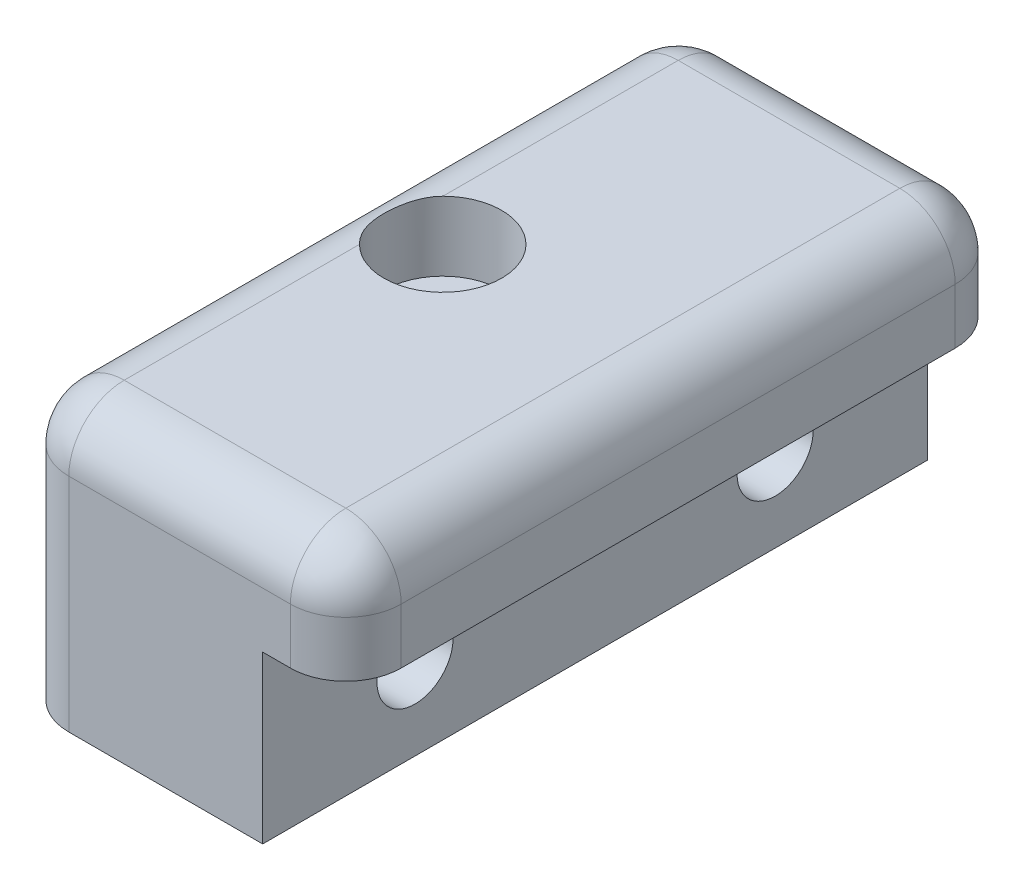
ISO-10303-21;
HEADER;
FILE_DESCRIPTION(('STEP AP214'),'2;1');
FILE_NAME('part.step','',(''),(''),'','','');
FILE_SCHEMA(('AUTOMOTIVE_DESIGN { 1 0 10303 214 1 1 1 1 }'));
ENDSEC;
DATA;
#1=APPLICATION_CONTEXT('core data for automotive mechanical design processes');
#2=APPLICATION_PROTOCOL_DEFINITION('international standard','automotive_design',2000,#1);
#3=PRODUCT_CONTEXT('',#1,'mechanical');
#4=PRODUCT('Part','Part','',(#3));
#5=PRODUCT_RELATED_PRODUCT_CATEGORY('part','',(#4));
#6=PRODUCT_DEFINITION_FORMATION('','',#4);
#7=PRODUCT_DEFINITION_CONTEXT('part definition',#1,'design');
#8=PRODUCT_DEFINITION('design','',#6,#7);
#9=PRODUCT_DEFINITION_SHAPE('','',#8);
#10=(LENGTH_UNIT() NAMED_UNIT(*) SI_UNIT(.MILLI.,.METRE.));
#11=(NAMED_UNIT(*) PLANE_ANGLE_UNIT() SI_UNIT($,.RADIAN.));
#12=(NAMED_UNIT(*) SI_UNIT($,.STERADIAN.) SOLID_ANGLE_UNIT());
#13=UNCERTAINTY_MEASURE_WITH_UNIT(LENGTH_MEASURE(1.E-05),#10,'distance_accuracy_value','');
#14=(GEOMETRIC_REPRESENTATION_CONTEXT(3) GLOBAL_UNCERTAINTY_ASSIGNED_CONTEXT((#13)) GLOBAL_UNIT_ASSIGNED_CONTEXT((#10,
#11,#12)) REPRESENTATION_CONTEXT('',''));
#15=CARTESIAN_POINT('',(0.,0.,0.));
#16=DIRECTION('',(0.,0.,1.));
#17=DIRECTION('',(1.,0.,0.));
#18=AXIS2_PLACEMENT_3D('',#15,#16,#17);
#19=CARTESIAN_POINT('',(38.1,0.,0.));
#20=DIRECTION('',(0.,0.,-1.));
#21=DIRECTION('',(-1.,0.,0.));
#22=AXIS2_PLACEMENT_3D('',#19,#20,#21);
#23=PLANE('',#22);
#24=DIRECTION('',(1.,0.,0.));
#25=VECTOR('',#24,1.);
#26=CARTESIAN_POINT('',(38.1,19.05,0.));
#27=LINE('',#26,#25);
#28=CARTESIAN_POINT('',(28.575,19.05,0.));
#29=VERTEX_POINT('',#28);
#30=CARTESIAN_POINT('',(31.75,19.05,0.));
#31=VERTEX_POINT('',#30);
#32=EDGE_CURVE('E139',#29,#31,#27,.T.);
#33=ORIENTED_EDGE('',*,*,#32,.T.);
#34=DIRECTION('',(0.,-1.,0.));
#35=VECTOR('',#34,1.);
#36=CARTESIAN_POINT('',(31.75,0.,0.));
#37=LINE('',#36,#35);
#38=CARTESIAN_POINT('',(31.75,25.4,0.));
#39=VERTEX_POINT('',#38);
#40=EDGE_CURVE('E189',#31,#39,#37,.F.);
#41=ORIENTED_EDGE('',*,*,#40,.T.);
#42=DIRECTION('',(-1.,0.,0.));
#43=VECTOR('',#42,1.);
#44=CARTESIAN_POINT('',(38.1,25.4,0.));
#45=LINE('',#44,#43);
#46=CARTESIAN_POINT('',(6.35,25.4,0.));
#47=VERTEX_POINT('',#46);
#48=EDGE_CURVE('E187',#39,#47,#45,.T.);
#49=ORIENTED_EDGE('',*,*,#48,.T.);
#50=DIRECTION('',(0.,-1.,0.));
#51=VECTOR('',#50,1.);
#52=CARTESIAN_POINT('',(6.35,0.,0.));
#53=LINE('',#52,#51);
#54=CARTESIAN_POINT('',(6.35000000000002,0.,0.));
#55=VERTEX_POINT('',#54);
#56=EDGE_CURVE('E152',#47,#55,#53,.T.);
#57=ORIENTED_EDGE('',*,*,#56,.T.);
#58=DIRECTION('',(-1.,0.,0.));
#59=VECTOR('',#58,1.);
#60=CARTESIAN_POINT('',(38.1,0.,0.));
#61=LINE('',#60,#59);
#62=CARTESIAN_POINT('',(28.575,0.,0.));
#63=VERTEX_POINT('',#62);
#64=EDGE_CURVE('E146',#63,#55,#61,.T.);
#65=ORIENTED_EDGE('',*,*,#64,.F.);
#66=DIRECTION('',(0.,1.,0.));
#67=VECTOR('',#66,1.);
#68=CARTESIAN_POINT('',(28.575,0.,0.));
#69=LINE('',#68,#67);
#70=EDGE_CURVE('E128',#63,#29,#69,.T.);
#71=ORIENTED_EDGE('',*,*,#70,.T.);
#72=EDGE_LOOP('',(#33,#41,#49,#57,#65,#71));
#73=FACE_BOUND('',#72,.T.);
#74=ADVANCED_FACE('F33',(#73),#23,.F.);
#75=CARTESIAN_POINT('',(38.1,0.,0.));
#76=DIRECTION('',(0.,1.,0.));
#77=DIRECTION('',(0.,0.,1.));
#78=AXIS2_PLACEMENT_3D('',#75,#76,#77);
#79=PLANE('',#78);
#80=CARTESIAN_POINT('',(11.1125,0.,-38.1));
#81=DIRECTION('',(0.,1.,0.));
#82=DIRECTION('',(0.,0.,1.));
#83=AXIS2_PLACEMENT_3D('',#80,#81,#82);
#84=CIRCLE('',#83,4.36498999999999);
#85=CARTESIAN_POINT('',(11.1125,0.,-33.73501));
#86=VERTEX_POINT('',#85);
#87=EDGE_CURVE('E352',#86,#86,#84,.T.);
#88=ORIENTED_EDGE('',*,*,#87,.T.);
#89=EDGE_LOOP('',(#88));
#90=FACE_BOUND('',#89,.T.);
#91=ORIENTED_EDGE('',*,*,#64,.T.);
#92=CARTESIAN_POINT('',(6.35,0.,-6.35));
#93=DIRECTION('',(0.,1.,0.));
#94=DIRECTION('',(0.,0.,1.));
#95=AXIS2_PLACEMENT_3D('',#92,#93,#94);
#96=CIRCLE('',#95,6.35);
#97=CARTESIAN_POINT('',(0.,0.,-6.35));
#98=VERTEX_POINT('',#97);
#99=EDGE_CURVE('E11',#55,#98,#96,.F.);
#100=ORIENTED_EDGE('',*,*,#99,.T.);
#101=DIRECTION('',(0.,0.,-1.));
#102=VECTOR('',#101,1.);
#103=CARTESIAN_POINT('',(0.,0.,0.));
#104=LINE('',#103,#102);
#105=CARTESIAN_POINT('',(0.,0.,-69.85));
#106=VERTEX_POINT('',#105);
#107=EDGE_CURVE('E157',#98,#106,#104,.T.);
#108=ORIENTED_EDGE('',*,*,#107,.T.);
#109=CARTESIAN_POINT('',(6.35,0.,-69.85));
#110=DIRECTION('',(0.,1.,0.));
#111=DIRECTION('',(0.,0.,1.));
#112=AXIS2_PLACEMENT_3D('',#109,#110,#111);
#113=CIRCLE('',#112,6.35);
#114=CARTESIAN_POINT('',(6.35000000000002,0.,-76.2));
#115=VERTEX_POINT('',#114);
#116=EDGE_CURVE('E42',#106,#115,#113,.F.);
#117=ORIENTED_EDGE('',*,*,#116,.T.);
#118=DIRECTION('',(-1.,0.,0.));
#119=VECTOR('',#118,1.);
#120=CARTESIAN_POINT('',(38.1,0.,-76.2));
#121=LINE('',#120,#119);
#122=CARTESIAN_POINT('',(28.575,0.,-76.2));
#123=VERTEX_POINT('',#122);
#124=EDGE_CURVE('E149',#123,#115,#121,.T.);
#125=ORIENTED_EDGE('',*,*,#124,.F.);
#126=DIRECTION('',(0.,0.,-1.));
#127=VECTOR('',#126,1.);
#128=CARTESIAN_POINT('',(28.575,0.,0.));
#129=LINE('',#128,#127);
#130=EDGE_CURVE('E132',#63,#123,#129,.T.);
#131=ORIENTED_EDGE('',*,*,#130,.F.);
#132=EDGE_LOOP('',(#91,#100,#108,#117,#125,#131));
#133=FACE_BOUND('',#132,.T.);
#134=ADVANCED_FACE('F145',(#90,#133),#79,.F.);
#135=CARTESIAN_POINT('',(38.1,0.,-76.2));
#136=DIRECTION('',(0.,0.,1.));
#137=DIRECTION('',(1.,0.,0.));
#138=AXIS2_PLACEMENT_3D('',#135,#136,#137);
#139=PLANE('',#138);
#140=DIRECTION('',(-1.,0.,0.));
#141=VECTOR('',#140,1.);
#142=CARTESIAN_POINT('',(38.1,25.4,-76.2));
#143=LINE('',#142,#141);
#144=CARTESIAN_POINT('',(6.35,25.4,-76.2));
#145=VERTEX_POINT('',#144);
#146=CARTESIAN_POINT('',(31.75,25.4,-76.2));
#147=VERTEX_POINT('',#146);
#148=EDGE_CURVE('E181',#145,#147,#143,.F.);
#149=ORIENTED_EDGE('',*,*,#148,.T.);
#150=DIRECTION('',(0.,1.,0.));
#151=VECTOR('',#150,1.);
#152=CARTESIAN_POINT('',(31.75,0.,-76.2));
#153=LINE('',#152,#151);
#154=CARTESIAN_POINT('',(31.75,19.05,-76.2));
#155=VERTEX_POINT('',#154);
#156=EDGE_CURVE('E184',#147,#155,#153,.F.);
#157=ORIENTED_EDGE('',*,*,#156,.T.);
#158=DIRECTION('',(1.,0.,0.));
#159=VECTOR('',#158,1.);
#160=CARTESIAN_POINT('',(38.1,19.05,-76.2));
#161=LINE('',#160,#159);
#162=CARTESIAN_POINT('',(28.575,19.05,-76.2));
#163=VERTEX_POINT('',#162);
#164=EDGE_CURVE('E140',#163,#155,#161,.T.);
#165=ORIENTED_EDGE('',*,*,#164,.F.);
#166=DIRECTION('',(0.,1.,0.));
#167=VECTOR('',#166,1.);
#168=CARTESIAN_POINT('',(28.575,0.,-76.2));
#169=LINE('',#168,#167);
#170=EDGE_CURVE('E164',#123,#163,#169,.T.);
#171=ORIENTED_EDGE('',*,*,#170,.F.);
#172=ORIENTED_EDGE('',*,*,#124,.T.);
#173=DIRECTION('',(0.,1.,0.));
#174=VECTOR('',#173,1.);
#175=CARTESIAN_POINT('',(6.35,31.75,-76.2));
#176=LINE('',#175,#174);
#177=EDGE_CURVE('E179',#115,#145,#176,.T.);
#178=ORIENTED_EDGE('',*,*,#177,.T.);
#179=EDGE_LOOP('',(#149,#157,#165,#171,#172,#178));
#180=FACE_BOUND('',#179,.T.);
#181=ADVANCED_FACE('F265',(#180),#139,.F.);
#182=CARTESIAN_POINT('',(38.1,31.75,0.));
#183=DIRECTION('',(0.,-1.,0.));
#184=DIRECTION('',(0.,0.,-1.));
#185=AXIS2_PLACEMENT_3D('',#182,#183,#184);
#186=PLANE('',#185);
#187=DIRECTION('',(-1.,0.,0.));
#188=VECTOR('',#187,1.);
#189=CARTESIAN_POINT('',(38.1,31.75,-69.85));
#190=LINE('',#189,#188);
#191=CARTESIAN_POINT('',(31.75,31.75,-69.85));
#192=VERTEX_POINT('',#191);
#193=CARTESIAN_POINT('',(6.35,31.75,-69.85));
#194=VERTEX_POINT('',#193);
#195=EDGE_CURVE('E174',#192,#194,#190,.T.);
#196=ORIENTED_EDGE('',*,*,#195,.T.);
#197=DIRECTION('',(0.,0.,1.));
#198=VECTOR('',#197,1.);
#199=CARTESIAN_POINT('',(6.35,31.75,0.));
#200=LINE('',#199,#198);
#201=CARTESIAN_POINT('',(6.35,31.75,-42.8799042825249));
#202=VERTEX_POINT('',#201);
#203=EDGE_CURVE('E177',#194,#202,#200,.T.);
#204=ORIENTED_EDGE('',*,*,#203,.T.);
#205=CARTESIAN_POINT('',(11.1125,31.75,-38.1));
#206=DIRECTION('',(0.,1.,0.));
#207=DIRECTION('',(0.,0.,1.));
#208=AXIS2_PLACEMENT_3D('',#205,#206,#207);
#209=CIRCLE('',#208,6.74750999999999);
#210=CARTESIAN_POINT('',(6.35,31.75,-33.3200957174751));
#211=VERTEX_POINT('',#210);
#212=EDGE_CURVE('E338',#211,#202,#209,.T.);
#213=ORIENTED_EDGE('',*,*,#212,.F.);
#214=DIRECTION('',(0.,0.,1.));
#215=VECTOR('',#214,1.);
#216=CARTESIAN_POINT('',(6.35,31.75,0.));
#217=LINE('',#216,#215);
#218=CARTESIAN_POINT('',(6.35,31.75,-6.35));
#219=VERTEX_POINT('',#218);
#220=EDGE_CURVE('E153',#211,#219,#217,.T.);
#221=ORIENTED_EDGE('',*,*,#220,.T.);
#222=DIRECTION('',(-1.,0.,0.));
#223=VECTOR('',#222,1.);
#224=CARTESIAN_POINT('',(38.1,31.75,-6.35));
#225=LINE('',#224,#223);
#226=CARTESIAN_POINT('',(31.75,31.75,-6.35));
#227=VERTEX_POINT('',#226);
#228=EDGE_CURVE('E155',#219,#227,#225,.F.);
#229=ORIENTED_EDGE('',*,*,#228,.T.);
#230=DIRECTION('',(0.,0.,1.));
#231=VECTOR('',#230,1.);
#232=CARTESIAN_POINT('',(31.75,31.75,0.));
#233=LINE('',#232,#231);
#234=EDGE_CURVE('E172',#227,#192,#233,.F.);
#235=ORIENTED_EDGE('',*,*,#234,.T.);
#236=EDGE_LOOP('',(#196,#204,#213,#221,#229,#235));
#237=FACE_BOUND('',#236,.T.);
#238=ADVANCED_FACE('F258',(#237),#186,.F.);
#239=CARTESIAN_POINT('',(38.1,0.,0.));
#240=DIRECTION('',(-1.,0.,0.));
#241=DIRECTION('',(0.,0.,1.));
#242=AXIS2_PLACEMENT_3D('',#239,#240,#241);
#243=PLANE('',#242);
#244=DIRECTION('',(0.,0.,1.));
#245=VECTOR('',#244,1.);
#246=CARTESIAN_POINT('',(38.1,25.4,0.));
#247=LINE('',#246,#245);
#248=CARTESIAN_POINT('',(38.1,25.4,-69.85));
#249=VERTEX_POINT('',#248);
#250=CARTESIAN_POINT('',(38.1,25.4,-6.35));
#251=VERTEX_POINT('',#250);
#252=EDGE_CURVE('E193',#249,#251,#247,.T.);
#253=ORIENTED_EDGE('',*,*,#252,.T.);
#254=DIRECTION('',(0.,-1.,0.));
#255=VECTOR('',#254,1.);
#256=CARTESIAN_POINT('',(38.1,0.,-6.35));
#257=LINE('',#256,#255);
#258=CARTESIAN_POINT('',(38.1,19.05,-6.35));
#259=VERTEX_POINT('',#258);
#260=EDGE_CURVE('E195',#251,#259,#257,.T.);
#261=ORIENTED_EDGE('',*,*,#260,.T.);
#262=DIRECTION('',(0.,0.,-1.));
#263=VECTOR('',#262,1.);
#264=CARTESIAN_POINT('',(38.1,19.05,0.));
#265=LINE('',#264,#263);
#266=CARTESIAN_POINT('',(38.1,19.05,-69.85));
#267=VERTEX_POINT('',#266);
#268=EDGE_CURVE('E374',#259,#267,#265,.T.);
#269=ORIENTED_EDGE('',*,*,#268,.T.);
#270=DIRECTION('',(0.,1.,0.));
#271=VECTOR('',#270,1.);
#272=CARTESIAN_POINT('',(38.1,0.,-69.85));
#273=LINE('',#272,#271);
#274=EDGE_CURVE('E191',#267,#249,#273,.T.);
#275=ORIENTED_EDGE('',*,*,#274,.T.);
#276=EDGE_LOOP('',(#253,#261,#269,#275));
#277=FACE_BOUND('',#276,.T.);
#278=ADVANCED_FACE('F255',(#277),#243,.F.);
#279=CARTESIAN_POINT('',(0.,0.,0.));
#280=DIRECTION('',(-1.,0.,0.));
#281=DIRECTION('',(0.,0.,1.));
#282=AXIS2_PLACEMENT_3D('',#279,#280,#281);
#283=PLANE('',#282);
#284=CARTESIAN_POINT('',(0.,9.525,-58.7375));
#285=DIRECTION('',(-1.,0.,0.));
#286=DIRECTION('',(0.,0.,1.));
#287=AXIS2_PLACEMENT_3D('',#284,#285,#286);
#288=CIRCLE('',#287,6.74751);
#289=CARTESIAN_POINT('',(0.,9.525,-51.98999));
#290=VERTEX_POINT('',#289);
#291=EDGE_CURVE('E355',#290,#290,#288,.T.);
#292=ORIENTED_EDGE('',*,*,#291,.F.);
#293=EDGE_LOOP('',(#292));
#294=FACE_BOUND('',#293,.T.);
#295=CARTESIAN_POINT('',(0.,9.525,-17.4625));
#296=DIRECTION('',(-1.,0.,0.));
#297=DIRECTION('',(0.,0.,1.));
#298=AXIS2_PLACEMENT_3D('',#295,#296,#297);
#299=CIRCLE('',#298,6.74751);
#300=CARTESIAN_POINT('',(0.,9.525,-10.71499));
#301=VERTEX_POINT('',#300);
#302=EDGE_CURVE('E168',#301,#301,#299,.T.);
#303=ORIENTED_EDGE('',*,*,#302,.F.);
#304=EDGE_LOOP('',(#303));
#305=FACE_BOUND('',#304,.T.);
#306=ORIENTED_EDGE('',*,*,#107,.F.);
#307=DIRECTION('',(0.,-1.,0.));
#308=VECTOR('',#307,1.);
#309=CARTESIAN_POINT('',(0.,31.75,-6.35));
#310=LINE('',#309,#308);
#311=CARTESIAN_POINT('',(0.,25.4,-6.35));
#312=VERTEX_POINT('',#311);
#313=EDGE_CURVE('E50',#98,#312,#310,.F.);
#314=ORIENTED_EDGE('',*,*,#313,.T.);
#315=DIRECTION('',(0.,0.,1.));
#316=VECTOR('',#315,1.);
#317=CARTESIAN_POINT('',(0.,25.4,-76.2));
#318=LINE('',#317,#316);
#319=CARTESIAN_POINT('',(0.,25.4,-69.85));
#320=VERTEX_POINT('',#319);
#321=EDGE_CURVE('E55',#312,#320,#318,.F.);
#322=ORIENTED_EDGE('',*,*,#321,.T.);
#323=DIRECTION('',(0.,1.,0.));
#324=VECTOR('',#323,1.);
#325=CARTESIAN_POINT('',(0.,0.,-69.85));
#326=LINE('',#325,#324);
#327=EDGE_CURVE('E204',#320,#106,#326,.F.);
#328=ORIENTED_EDGE('',*,*,#327,.T.);
#329=EDGE_LOOP('',(#306,#314,#322,#328));
#330=FACE_BOUND('',#329,.T.);
#331=ADVANCED_FACE('F250',(#294,#305,#330),#283,.T.);
#332=CARTESIAN_POINT('',(38.1,19.05,0.));
#333=DIRECTION('',(0.,1.,0.));
#334=DIRECTION('',(-1.,0.,0.));
#335=AXIS2_PLACEMENT_3D('',#332,#333,#334);
#336=PLANE('',#335);
#337=ORIENTED_EDGE('',*,*,#268,.F.);
#338=CARTESIAN_POINT('',(31.75,19.05,-6.35));
#339=DIRECTION('',(0.,1.,0.));
#340=DIRECTION('',(-1.,0.,0.));
#341=AXIS2_PLACEMENT_3D('',#338,#339,#340);
#342=CIRCLE('',#341,6.35);
#343=EDGE_CURVE('E299',#259,#31,#342,.F.);
#344=ORIENTED_EDGE('',*,*,#343,.T.);
#345=ORIENTED_EDGE('',*,*,#32,.F.);
#346=DIRECTION('',(0.,0.,-1.));
#347=VECTOR('',#346,1.);
#348=CARTESIAN_POINT('',(28.575,19.05,0.));
#349=LINE('',#348,#347);
#350=EDGE_CURVE('E134',#29,#163,#349,.T.);
#351=ORIENTED_EDGE('',*,*,#350,.T.);
#352=ORIENTED_EDGE('',*,*,#164,.T.);
#353=CARTESIAN_POINT('',(31.75,19.05,-69.85));
#354=DIRECTION('',(0.,1.,0.));
#355=DIRECTION('',(-1.,0.,0.));
#356=AXIS2_PLACEMENT_3D('',#353,#354,#355);
#357=CIRCLE('',#356,6.35);
#358=EDGE_CURVE('E301',#155,#267,#357,.F.);
#359=ORIENTED_EDGE('',*,*,#358,.T.);
#360=EDGE_LOOP('',(#337,#344,#345,#351,#352,#359));
#361=FACE_BOUND('',#360,.T.);
#362=ADVANCED_FACE('F247',(#361),#336,.F.);
#363=CARTESIAN_POINT('',(28.575,0.,0.));
#364=DIRECTION('',(-1.,0.,0.));
#365=DIRECTION('',(0.,0.,1.));
#366=AXIS2_PLACEMENT_3D('',#363,#364,#365);
#367=PLANE('',#366);
#368=CARTESIAN_POINT('',(28.575,9.525,-58.7375));
#369=DIRECTION('',(-1.,0.,0.));
#370=DIRECTION('',(0.,0.,1.));
#371=AXIS2_PLACEMENT_3D('',#368,#369,#370);
#372=CIRCLE('',#371,4.36498999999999);
#373=CARTESIAN_POINT('',(28.575,9.525,-54.37251));
#374=VERTEX_POINT('',#373);
#375=EDGE_CURVE('E166',#374,#374,#372,.T.);
#376=ORIENTED_EDGE('',*,*,#375,.T.);
#377=EDGE_LOOP('',(#376));
#378=FACE_BOUND('',#377,.T.);
#379=CARTESIAN_POINT('',(28.575,9.525,-17.4625));
#380=DIRECTION('',(-1.,0.,0.));
#381=DIRECTION('',(0.,0.,1.));
#382=AXIS2_PLACEMENT_3D('',#379,#380,#381);
#383=CIRCLE('',#382,4.36498999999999);
#384=CARTESIAN_POINT('',(28.575,9.525,-13.09751));
#385=VERTEX_POINT('',#384);
#386=EDGE_CURVE('E161',#385,#385,#383,.T.);
#387=ORIENTED_EDGE('',*,*,#386,.T.);
#388=EDGE_LOOP('',(#387));
#389=FACE_BOUND('',#388,.T.);
#390=ORIENTED_EDGE('',*,*,#170,.T.);
#391=ORIENTED_EDGE('',*,*,#350,.F.);
#392=ORIENTED_EDGE('',*,*,#70,.F.);
#393=ORIENTED_EDGE('',*,*,#130,.T.);
#394=EDGE_LOOP('',(#390,#391,#392,#393));
#395=FACE_BOUND('',#394,.T.);
#396=ADVANCED_FACE('F131',(#378,#389,#395),#367,.F.);
#397=CARTESIAN_POINT('',(0.,9.525,-17.4625));
#398=DIRECTION('',(-1.,0.,0.));
#399=DIRECTION('',(0.,0.,1.));
#400=AXIS2_PLACEMENT_3D('',#397,#398,#399);
#401=CYLINDRICAL_SURFACE('',#400,4.36498999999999);
#402=CARTESIAN_POINT('',(7.9375,9.525,-17.4625));
#403=DIRECTION('',(-1.,0.,0.));
#404=DIRECTION('',(0.,0.,1.));
#405=AXIS2_PLACEMENT_3D('',#402,#403,#404);
#406=CIRCLE('',#405,4.36499);
#407=CARTESIAN_POINT('',(7.9375,9.525,-13.09751));
#408=VERTEX_POINT('',#407);
#409=EDGE_CURVE('E165',#408,#408,#406,.T.);
#410=ORIENTED_EDGE('',*,*,#409,.T.);
#411=EDGE_LOOP('',(#410));
#412=FACE_BOUND('',#411,.T.);
#413=ORIENTED_EDGE('',*,*,#386,.F.);
#414=EDGE_LOOP('',(#413));
#415=FACE_BOUND('',#414,.T.);
#416=ADVANCED_FACE('F242',(#412,#415),#401,.F.);
#417=CARTESIAN_POINT('',(7.9375,13.88999,-17.4625));
#418=DIRECTION('',(1.,0.,0.));
#419=DIRECTION('',(0.,0.,-1.));
#420=AXIS2_PLACEMENT_3D('',#417,#418,#419);
#421=PLANE('',#420);
#422=ORIENTED_EDGE('',*,*,#409,.F.);
#423=EDGE_LOOP('',(#422));
#424=FACE_BOUND('',#423,.T.);
#425=CARTESIAN_POINT('',(7.9375,9.525,-17.4625));
#426=DIRECTION('',(-1.,0.,0.));
#427=DIRECTION('',(0.,0.,1.));
#428=AXIS2_PLACEMENT_3D('',#425,#426,#427);
#429=CIRCLE('',#428,6.74751);
#430=CARTESIAN_POINT('',(7.9375,9.525,-10.71499));
#431=VERTEX_POINT('',#430);
#432=EDGE_CURVE('E365',#431,#431,#429,.T.);
#433=ORIENTED_EDGE('',*,*,#432,.T.);
#434=EDGE_LOOP('',(#433));
#435=FACE_BOUND('',#434,.T.);
#436=ADVANCED_FACE('F238',(#424,#435),#421,.F.);
#437=CARTESIAN_POINT('',(0.,9.525,-17.4625));
#438=DIRECTION('',(-1.,0.,0.));
#439=DIRECTION('',(0.,0.,1.));
#440=AXIS2_PLACEMENT_3D('',#437,#438,#439);
#441=CYLINDRICAL_SURFACE('',#440,6.74751);
#442=ORIENTED_EDGE('',*,*,#432,.F.);
#443=EDGE_LOOP('',(#442));
#444=FACE_BOUND('',#443,.T.);
#445=ORIENTED_EDGE('',*,*,#302,.T.);
#446=EDGE_LOOP('',(#445));
#447=FACE_BOUND('',#446,.T.);
#448=ADVANCED_FACE('F234',(#444,#447),#441,.F.);
#449=CARTESIAN_POINT('',(0.,9.525,-58.7375));
#450=DIRECTION('',(-1.,0.,0.));
#451=DIRECTION('',(0.,0.,1.));
#452=AXIS2_PLACEMENT_3D('',#449,#450,#451);
#453=CYLINDRICAL_SURFACE('',#452,4.36498999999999);
#454=CARTESIAN_POINT('',(7.9375,9.525,-58.7375));
#455=DIRECTION('',(-1.,0.,0.));
#456=DIRECTION('',(0.,0.,1.));
#457=AXIS2_PLACEMENT_3D('',#454,#455,#456);
#458=CIRCLE('',#457,4.36499);
#459=CARTESIAN_POINT('',(7.9375,9.525,-54.37251));
#460=VERTEX_POINT('',#459);
#461=EDGE_CURVE('E169',#460,#460,#458,.T.);
#462=ORIENTED_EDGE('',*,*,#461,.T.);
#463=EDGE_LOOP('',(#462));
#464=FACE_BOUND('',#463,.T.);
#465=ORIENTED_EDGE('',*,*,#375,.F.);
#466=EDGE_LOOP('',(#465));
#467=FACE_BOUND('',#466,.T.);
#468=ADVANCED_FACE('F230',(#464,#467),#453,.F.);
#469=CARTESIAN_POINT('',(7.9375,13.88999,-58.7375));
#470=DIRECTION('',(1.,0.,0.));
#471=DIRECTION('',(0.,0.,-1.));
#472=AXIS2_PLACEMENT_3D('',#469,#470,#471);
#473=PLANE('',#472);
#474=ORIENTED_EDGE('',*,*,#461,.F.);
#475=EDGE_LOOP('',(#474));
#476=FACE_BOUND('',#475,.T.);
#477=CARTESIAN_POINT('',(7.9375,9.525,-58.7375));
#478=DIRECTION('',(-1.,0.,0.));
#479=DIRECTION('',(0.,0.,1.));
#480=AXIS2_PLACEMENT_3D('',#477,#478,#479);
#481=CIRCLE('',#480,6.74751);
#482=CARTESIAN_POINT('',(7.9375,9.525,-51.98999));
#483=VERTEX_POINT('',#482);
#484=EDGE_CURVE('E358',#483,#483,#481,.T.);
#485=ORIENTED_EDGE('',*,*,#484,.T.);
#486=EDGE_LOOP('',(#485));
#487=FACE_BOUND('',#486,.T.);
#488=ADVANCED_FACE('F226',(#476,#487),#473,.F.);
#489=CARTESIAN_POINT('',(0.,9.525,-58.7375));
#490=DIRECTION('',(-1.,0.,0.));
#491=DIRECTION('',(0.,0.,1.));
#492=AXIS2_PLACEMENT_3D('',#489,#490,#491);
#493=CYLINDRICAL_SURFACE('',#492,6.74751);
#494=ORIENTED_EDGE('',*,*,#484,.F.);
#495=EDGE_LOOP('',(#494));
#496=FACE_BOUND('',#495,.T.);
#497=ORIENTED_EDGE('',*,*,#291,.T.);
#498=EDGE_LOOP('',(#497));
#499=FACE_BOUND('',#498,.T.);
#500=ADVANCED_FACE('F222',(#496,#499),#493,.F.);
#501=CARTESIAN_POINT('',(11.1125,31.75,-38.1));
#502=DIRECTION('',(0.,1.,0.));
#503=DIRECTION('',(0.,0.,1.));
#504=AXIS2_PLACEMENT_3D('',#501,#502,#503);
#505=CYLINDRICAL_SURFACE('',#504,4.36499);
#506=ORIENTED_EDGE('',*,*,#87,.F.);
#507=EDGE_LOOP('',(#506));
#508=FACE_BOUND('',#507,.T.);
#509=CARTESIAN_POINT('',(11.1125,23.8125,-38.1));
#510=DIRECTION('',(0.,1.,0.));
#511=DIRECTION('',(0.,0.,1.));
#512=AXIS2_PLACEMENT_3D('',#509,#510,#511);
#513=CIRCLE('',#512,4.36499000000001);
#514=CARTESIAN_POINT('',(11.1125,23.8125,-33.73501));
#515=VERTEX_POINT('',#514);
#516=EDGE_CURVE('E347',#515,#515,#513,.T.);
#517=ORIENTED_EDGE('',*,*,#516,.T.);
#518=EDGE_LOOP('',(#517));
#519=FACE_BOUND('',#518,.T.);
#520=ADVANCED_FACE('F218',(#508,#519),#505,.F.);
#521=CARTESIAN_POINT('',(15.47749,23.8125,-38.1));
#522=DIRECTION('',(0.,-1.,0.));
#523=DIRECTION('',(0.,0.,-1.));
#524=AXIS2_PLACEMENT_3D('',#521,#522,#523);
#525=PLANE('',#524);
#526=ORIENTED_EDGE('',*,*,#516,.F.);
#527=EDGE_LOOP('',(#526));
#528=FACE_BOUND('',#527,.T.);
#529=CARTESIAN_POINT('',(11.1125,23.8125,-38.1));
#530=DIRECTION('',(0.,1.,0.));
#531=DIRECTION('',(0.,0.,1.));
#532=AXIS2_PLACEMENT_3D('',#529,#530,#531);
#533=CIRCLE('',#532,6.74750999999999);
#534=CARTESIAN_POINT('',(11.1125,23.8125,-31.35249));
#535=VERTEX_POINT('',#534);
#536=EDGE_CURVE('E341',#535,#535,#533,.T.);
#537=ORIENTED_EDGE('',*,*,#536,.T.);
#538=EDGE_LOOP('',(#537));
#539=FACE_BOUND('',#538,.T.);
#540=ADVANCED_FACE('F214',(#528,#539),#525,.F.);
#541=CARTESIAN_POINT('',(11.1125,31.75,-38.1));
#542=DIRECTION('',(0.,1.,0.));
#543=DIRECTION('',(0.,0.,1.));
#544=AXIS2_PLACEMENT_3D('',#541,#542,#543);
#545=CYLINDRICAL_SURFACE('',#544,6.74750999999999);
#546=ORIENTED_EDGE('',*,*,#536,.F.);
#547=EDGE_LOOP('',(#546));
#548=FACE_BOUND('',#547,.T.);
#549=ORIENTED_EDGE('',*,*,#212,.T.);
#550=CARTESIAN_POINT('',(6.35,31.75,-42.8799042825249));
#551=CARTESIAN_POINT('',(6.21753326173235,31.7499920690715,-42.7479539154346));
#552=CARTESIAN_POINT('',(6.09064501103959,31.745855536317,-42.6105252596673));
#553=CARTESIAN_POINT('',(5.84891779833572,31.7313576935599,-42.3259126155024));
#554=CARTESIAN_POINT('',(5.73407019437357,31.7210008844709,-42.1787357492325));
#555=CARTESIAN_POINT('',(5.51715001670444,31.6960921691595,-41.8756720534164));
#556=CARTESIAN_POINT('',(5.41507424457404,31.6815413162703,-41.7197874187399));
#557=CARTESIAN_POINT('',(5.22422566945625,31.6501590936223,-41.4002644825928));
#558=CARTESIAN_POINT('',(5.13545524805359,31.6333273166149,-41.2366247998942));
#559=CARTESIAN_POINT('',(4.97187819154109,31.5992138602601,-40.9028803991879));
#560=CARTESIAN_POINT('',(4.89704970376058,31.5819329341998,-40.7327863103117));
#561=CARTESIAN_POINT('',(4.76163970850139,31.5485346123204,-40.3869091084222));
#562=CARTESIAN_POINT('',(4.70105782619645,31.5324171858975,-40.2111261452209));
#563=CARTESIAN_POINT('',(4.59459116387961,31.5027940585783,-39.8550667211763));
#564=CARTESIAN_POINT('',(4.54869692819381,31.4892866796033,-39.6747932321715));
#565=CARTESIAN_POINT('',(4.4719153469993,31.4660457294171,-39.3108323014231));
#566=CARTESIAN_POINT('',(4.44102795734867,31.4563121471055,-39.1271448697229));
#567=CARTESIAN_POINT('',(4.39427028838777,31.4413769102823,-38.7555482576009));
#568=CARTESIAN_POINT('',(4.37857509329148,31.4362281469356,-38.5676148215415));
#569=CARTESIAN_POINT('',(4.36297237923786,31.4311101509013,-38.1910198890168));
#570=CARTESIAN_POINT('',(4.36306499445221,31.431140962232,-38.0023583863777));
#571=CARTESIAN_POINT('',(4.37903996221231,31.4363801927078,-37.625709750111));
#572=CARTESIAN_POINT('',(4.39492818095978,31.4415905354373,-37.4377228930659));
#573=CARTESIAN_POINT('',(4.44234637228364,31.4567296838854,-37.0639331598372));
#574=CARTESIAN_POINT('',(4.473876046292,31.4666583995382,-36.8781302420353));
#575=CARTESIAN_POINT('',(4.55077780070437,31.4898967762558,-36.5171454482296));
#576=CARTESIAN_POINT('',(4.59556998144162,31.503061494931,-36.3418301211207));
#577=CARTESIAN_POINT('',(4.69901158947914,31.5318526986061,-35.9955484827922));
#578=CARTESIAN_POINT('',(4.7576612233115,31.5474792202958,-35.8245822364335));
#579=CARTESIAN_POINT('',(4.8884001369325,31.5798667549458,-35.4881007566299));
#580=CARTESIAN_POINT('',(4.96048061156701,31.5966270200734,-35.3225820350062));
#581=CARTESIAN_POINT('',(5.11767693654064,31.6297941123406,-34.9978105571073));
#582=CARTESIAN_POINT('',(5.2027962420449,31.6462008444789,-34.8385594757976));
#583=CARTESIAN_POINT('',(5.43983711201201,31.6861675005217,-34.434994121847));
#584=CARTESIAN_POINT('',(5.60148755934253,31.7082169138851,-34.1960939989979));
#585=CARTESIAN_POINT('',(5.86604759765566,31.732150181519,-33.8544806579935));
#586=CARTESIAN_POINT('',(5.95793603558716,31.7386048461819,-33.7433780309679));
#587=CARTESIAN_POINT('',(6.14877009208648,31.7475294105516,-33.5271374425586));
#588=CARTESIAN_POINT('',(6.24771952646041,31.7499971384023,-33.4220027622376));
#589=CARTESIAN_POINT('',(6.35,31.75,-33.3200957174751));
#590=B_SPLINE_CURVE_WITH_KNOTS('',3,(#550,#551,#552,#553,#554,#555,#556,#557,#558,#559,#560,
#561,#562,#563,#564,#565,#566,#567,#568,#569,#570,#571,#572,#573,#574,#575,#576,#577,#578,#579,
#580,#581,#582,#583,#584,#585,#586,#587,#588,#589),.UNSPECIFIED.,.F.,.F.,(4,2,2,2,2,2,2,2,2,2,2,
2,2,2,2,2,2,2,2,4),(0.,0.560585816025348,1.12076648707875,1.68080659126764,2.24094682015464,
2.80020155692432,3.359441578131,3.91832084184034,4.47719846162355,5.04244284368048,
5.60769202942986,6.1731512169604,6.73859961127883,7.28227017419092,7.82594884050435,
8.36927232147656,8.91274002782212,9.77772932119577,10.2104007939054,10.643307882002),.UNSPECIFIED.);
#591=EDGE_CURVE('E197',#202,#211,#590,.T.);
#592=ORIENTED_EDGE('',*,*,#591,.T.);
#593=EDGE_LOOP('',(#549,#592));
#594=FACE_BOUND('',#593,.T.);
#595=ADVANCED_FACE('F210',(#548,#594),#545,.F.);
#596=CARTESIAN_POINT('',(31.75,0.,-6.35));
#597=DIRECTION('',(0.,-1.,0.));
#598=DIRECTION('',(0.,0.,-1.));
#599=AXIS2_PLACEMENT_3D('',#596,#597,#598);
#600=CYLINDRICAL_SURFACE('',#599,6.35);
#601=ORIENTED_EDGE('',*,*,#343,.F.);
#602=ORIENTED_EDGE('',*,*,#260,.F.);
#603=CARTESIAN_POINT('',(31.75,25.4,-6.35));
#604=DIRECTION('',(0.,1.,0.));
#605=DIRECTION('',(0.,0.,1.));
#606=AXIS2_PLACEMENT_3D('',#603,#604,#605);
#607=CIRCLE('',#606,6.35);
#608=EDGE_CURVE('E37',#39,#251,#607,.T.);
#609=ORIENTED_EDGE('',*,*,#608,.F.);
#610=ORIENTED_EDGE('',*,*,#40,.F.);
#611=EDGE_LOOP('',(#601,#602,#609,#610));
#612=FACE_BOUND('',#611,.T.);
#613=ADVANCED_FACE('F35',(#612),#600,.T.);
#614=CARTESIAN_POINT('',(38.1,25.4,-6.35));
#615=DIRECTION('',(-1.,0.,0.));
#616=DIRECTION('',(0.,0.,1.));
#617=AXIS2_PLACEMENT_3D('',#614,#615,#616);
#618=CYLINDRICAL_SURFACE('',#617,6.35);
#619=CARTESIAN_POINT('',(6.35,25.4,-6.35));
#620=DIRECTION('',(-1.,0.,0.));
#621=DIRECTION('',(0.,0.,1.));
#622=AXIS2_PLACEMENT_3D('',#619,#620,#621);
#623=CIRCLE('',#622,6.35);
#624=EDGE_CURVE('E330',#47,#219,#623,.T.);
#625=ORIENTED_EDGE('',*,*,#624,.F.);
#626=ORIENTED_EDGE('',*,*,#48,.F.);
#627=CARTESIAN_POINT('',(31.75,25.4,-6.35));
#628=DIRECTION('',(1.,0.,0.));
#629=DIRECTION('',(0.,0.,-1.));
#630=AXIS2_PLACEMENT_3D('',#627,#628,#629);
#631=CIRCLE('',#630,6.35);
#632=EDGE_CURVE('E332',#227,#39,#631,.T.);
#633=ORIENTED_EDGE('',*,*,#632,.F.);
#634=ORIENTED_EDGE('',*,*,#228,.F.);
#635=EDGE_LOOP('',(#625,#626,#633,#634));
#636=FACE_BOUND('',#635,.T.);
#637=ADVANCED_FACE('F402',(#636),#618,.T.);
#638=CARTESIAN_POINT('',(6.35,0.,-6.35));
#639=DIRECTION('',(0.,1.,0.));
#640=DIRECTION('',(0.,0.,1.));
#641=AXIS2_PLACEMENT_3D('',#638,#639,#640);
#642=CYLINDRICAL_SURFACE('',#641,6.35);
#643=ORIENTED_EDGE('',*,*,#99,.F.);
#644=ORIENTED_EDGE('',*,*,#56,.F.);
#645=CARTESIAN_POINT('',(6.35,25.4,-6.35));
#646=DIRECTION('',(0.,1.,0.));
#647=DIRECTION('',(0.,0.,1.));
#648=AXIS2_PLACEMENT_3D('',#645,#646,#647);
#649=CIRCLE('',#648,6.35);
#650=EDGE_CURVE('E327',#312,#47,#649,.T.);
#651=ORIENTED_EDGE('',*,*,#650,.F.);
#652=ORIENTED_EDGE('',*,*,#313,.F.);
#653=EDGE_LOOP('',(#643,#644,#651,#652));
#654=FACE_BOUND('',#653,.T.);
#655=ADVANCED_FACE('F378',(#654),#642,.T.);
#656=CARTESIAN_POINT('',(31.75,25.4,-6.35));
#657=DIRECTION('',(0.,0.,1.));
#658=DIRECTION('',(1.,0.,0.));
#659=AXIS2_PLACEMENT_3D('',#656,#657,#658);
#660=SPHERICAL_SURFACE('',#659,6.35);
#661=ORIENTED_EDGE('',*,*,#632,.T.);
#662=ORIENTED_EDGE('',*,*,#608,.T.);
#663=CARTESIAN_POINT('',(31.75,25.4,-6.35));
#664=DIRECTION('',(0.,0.,1.));
#665=DIRECTION('',(1.,0.,0.));
#666=AXIS2_PLACEMENT_3D('',#663,#664,#665);
#667=CIRCLE('',#666,6.35);
#668=EDGE_CURVE('E324',#227,#251,#667,.F.);
#669=ORIENTED_EDGE('',*,*,#668,.F.);
#670=EDGE_LOOP('',(#661,#662,#669));
#671=FACE_BOUND('',#670,.T.);
#672=ADVANCED_FACE('F411',(#671),#660,.T.);
#673=CARTESIAN_POINT('',(6.35,25.4,-6.35));
#674=DIRECTION('',(0.,0.,1.));
#675=DIRECTION('',(1.,0.,0.));
#676=AXIS2_PLACEMENT_3D('',#673,#674,#675);
#677=SPHERICAL_SURFACE('',#676,6.35);
#678=ORIENTED_EDGE('',*,*,#650,.T.);
#679=ORIENTED_EDGE('',*,*,#624,.T.);
#680=CARTESIAN_POINT('',(6.35,25.4,-6.35));
#681=DIRECTION('',(0.,0.,1.));
#682=DIRECTION('',(1.,0.,0.));
#683=AXIS2_PLACEMENT_3D('',#680,#681,#682);
#684=CIRCLE('',#683,6.35);
#685=EDGE_CURVE('E321',#312,#219,#684,.F.);
#686=ORIENTED_EDGE('',*,*,#685,.F.);
#687=EDGE_LOOP('',(#678,#679,#686));
#688=FACE_BOUND('',#687,.T.);
#689=ADVANCED_FACE('F405',(#688),#677,.T.);
#690=CARTESIAN_POINT('',(31.75,0.,-69.85));
#691=DIRECTION('',(0.,1.,0.));
#692=DIRECTION('',(0.,0.,1.));
#693=AXIS2_PLACEMENT_3D('',#690,#691,#692);
#694=CYLINDRICAL_SURFACE('',#693,6.35);
#695=ORIENTED_EDGE('',*,*,#358,.F.);
#696=ORIENTED_EDGE('',*,*,#156,.F.);
#697=CARTESIAN_POINT('',(31.75,25.4,-69.85));
#698=DIRECTION('',(0.,1.,0.));
#699=DIRECTION('',(0.,0.,1.));
#700=AXIS2_PLACEMENT_3D('',#697,#698,#699);
#701=CIRCLE('',#700,6.35);
#702=EDGE_CURVE('E318',#249,#147,#701,.T.);
#703=ORIENTED_EDGE('',*,*,#702,.F.);
#704=ORIENTED_EDGE('',*,*,#274,.F.);
#705=EDGE_LOOP('',(#695,#696,#703,#704));
#706=FACE_BOUND('',#705,.T.);
#707=ADVANCED_FACE('F391',(#706),#694,.T.);
#708=CARTESIAN_POINT('',(31.75,25.4,0.));
#709=DIRECTION('',(0.,0.,1.));
#710=DIRECTION('',(1.,0.,0.));
#711=AXIS2_PLACEMENT_3D('',#708,#709,#710);
#712=CYLINDRICAL_SURFACE('',#711,6.35);
#713=ORIENTED_EDGE('',*,*,#668,.T.);
#714=ORIENTED_EDGE('',*,*,#252,.F.);
#715=CARTESIAN_POINT('',(31.75,25.4,-69.85));
#716=DIRECTION('',(0.,0.,-1.));
#717=DIRECTION('',(-1.,0.,0.));
#718=AXIS2_PLACEMENT_3D('',#715,#716,#717);
#719=CIRCLE('',#718,6.35);
#720=EDGE_CURVE('E315',#192,#249,#719,.T.);
#721=ORIENTED_EDGE('',*,*,#720,.F.);
#722=ORIENTED_EDGE('',*,*,#234,.F.);
#723=EDGE_LOOP('',(#713,#714,#721,#722));
#724=FACE_BOUND('',#723,.T.);
#725=ADVANCED_FACE('F292',(#724),#712,.T.);
#726=CARTESIAN_POINT('',(6.35,25.4,0.));
#727=DIRECTION('',(0.,0.,-1.));
#728=DIRECTION('',(-1.,0.,0.));
#729=AXIS2_PLACEMENT_3D('',#726,#727,#728);
#730=CYLINDRICAL_SURFACE('',#729,6.35);
#731=ORIENTED_EDGE('',*,*,#591,.F.);
#732=ORIENTED_EDGE('',*,*,#203,.F.);
#733=CARTESIAN_POINT('',(6.35,25.4,-69.85));
#734=DIRECTION('',(0.,0.,-1.));
#735=DIRECTION('',(-1.,0.,0.));
#736=AXIS2_PLACEMENT_3D('',#733,#734,#735);
#737=CIRCLE('',#736,6.35);
#738=EDGE_CURVE('E312',#320,#194,#737,.T.);
#739=ORIENTED_EDGE('',*,*,#738,.F.);
#740=ORIENTED_EDGE('',*,*,#321,.F.);
#741=ORIENTED_EDGE('',*,*,#685,.T.);
#742=ORIENTED_EDGE('',*,*,#220,.F.);
#743=EDGE_LOOP('',(#731,#732,#739,#740,#741,#742));
#744=FACE_BOUND('',#743,.T.);
#745=ADVANCED_FACE('F206',(#744),#730,.T.);
#746=CARTESIAN_POINT('',(6.35,0.,-69.85));
#747=DIRECTION('',(0.,-1.,0.));
#748=DIRECTION('',(0.,0.,-1.));
#749=AXIS2_PLACEMENT_3D('',#746,#747,#748);
#750=CYLINDRICAL_SURFACE('',#749,6.35);
#751=ORIENTED_EDGE('',*,*,#116,.F.);
#752=ORIENTED_EDGE('',*,*,#327,.F.);
#753=CARTESIAN_POINT('',(6.35,25.4,-69.85));
#754=DIRECTION('',(0.,1.,0.));
#755=DIRECTION('',(0.,0.,1.));
#756=AXIS2_PLACEMENT_3D('',#753,#754,#755);
#757=CIRCLE('',#756,6.35);
#758=EDGE_CURVE('E309',#145,#320,#757,.T.);
#759=ORIENTED_EDGE('',*,*,#758,.F.);
#760=ORIENTED_EDGE('',*,*,#177,.F.);
#761=EDGE_LOOP('',(#751,#752,#759,#760));
#762=FACE_BOUND('',#761,.T.);
#763=ADVANCED_FACE('F285',(#762),#750,.T.);
#764=CARTESIAN_POINT('',(31.75,25.4,-69.85));
#765=DIRECTION('',(0.,0.,1.));
#766=DIRECTION('',(1.,0.,0.));
#767=AXIS2_PLACEMENT_3D('',#764,#765,#766);
#768=SPHERICAL_SURFACE('',#767,6.35);
#769=ORIENTED_EDGE('',*,*,#720,.T.);
#770=ORIENTED_EDGE('',*,*,#702,.T.);
#771=CARTESIAN_POINT('',(31.75,25.4,-69.85));
#772=DIRECTION('',(1.,0.,0.));
#773=DIRECTION('',(0.,0.,-1.));
#774=AXIS2_PLACEMENT_3D('',#771,#772,#773);
#775=CIRCLE('',#774,6.35);
#776=EDGE_CURVE('E307',#192,#147,#775,.F.);
#777=ORIENTED_EDGE('',*,*,#776,.F.);
#778=EDGE_LOOP('',(#769,#770,#777));
#779=FACE_BOUND('',#778,.T.);
#780=ADVANCED_FACE('F282',(#779),#768,.T.);
#781=CARTESIAN_POINT('',(6.35,25.4,-69.85));
#782=DIRECTION('',(0.,0.,1.));
#783=DIRECTION('',(1.,0.,0.));
#784=AXIS2_PLACEMENT_3D('',#781,#782,#783);
#785=SPHERICAL_SURFACE('',#784,6.35);
#786=ORIENTED_EDGE('',*,*,#758,.T.);
#787=ORIENTED_EDGE('',*,*,#738,.T.);
#788=CARTESIAN_POINT('',(6.35,25.4,-69.85));
#789=DIRECTION('',(-1.,0.,0.));
#790=DIRECTION('',(0.,0.,1.));
#791=AXIS2_PLACEMENT_3D('',#788,#789,#790);
#792=CIRCLE('',#791,6.35);
#793=EDGE_CURVE('E305',#145,#194,#792,.F.);
#794=ORIENTED_EDGE('',*,*,#793,.F.);
#795=EDGE_LOOP('',(#786,#787,#794));
#796=FACE_BOUND('',#795,.T.);
#797=ADVANCED_FACE('F278',(#796),#785,.T.);
#798=CARTESIAN_POINT('',(38.1,25.4,-69.85));
#799=DIRECTION('',(-1.,0.,0.));
#800=DIRECTION('',(0.,0.,1.));
#801=AXIS2_PLACEMENT_3D('',#798,#799,#800);
#802=CYLINDRICAL_SURFACE('',#801,6.35);
#803=ORIENTED_EDGE('',*,*,#776,.T.);
#804=ORIENTED_EDGE('',*,*,#148,.F.);
#805=ORIENTED_EDGE('',*,*,#793,.T.);
#806=ORIENTED_EDGE('',*,*,#195,.F.);
#807=EDGE_LOOP('',(#803,#804,#805,#806));
#808=FACE_BOUND('',#807,.T.);
#809=ADVANCED_FACE('F275',(#808),#802,.T.);
#810=CLOSED_SHELL('',(#74,#134,#181,#238,#278,#331,#362,#396,#416,#436,#448,#468,#488,#500,#520,
#540,#595,#613,#637,#655,#672,#689,#707,#725,#745,#763,#780,#797,#809));
#811=MANIFOLD_SOLID_BREP('B2',#810);
#812=ADVANCED_BREP_SHAPE_REPRESENTATION('',(#18,#811),#14);
#813=SHAPE_DEFINITION_REPRESENTATION(#9,#812);
ENDSEC;
END-ISO-10303-21;
